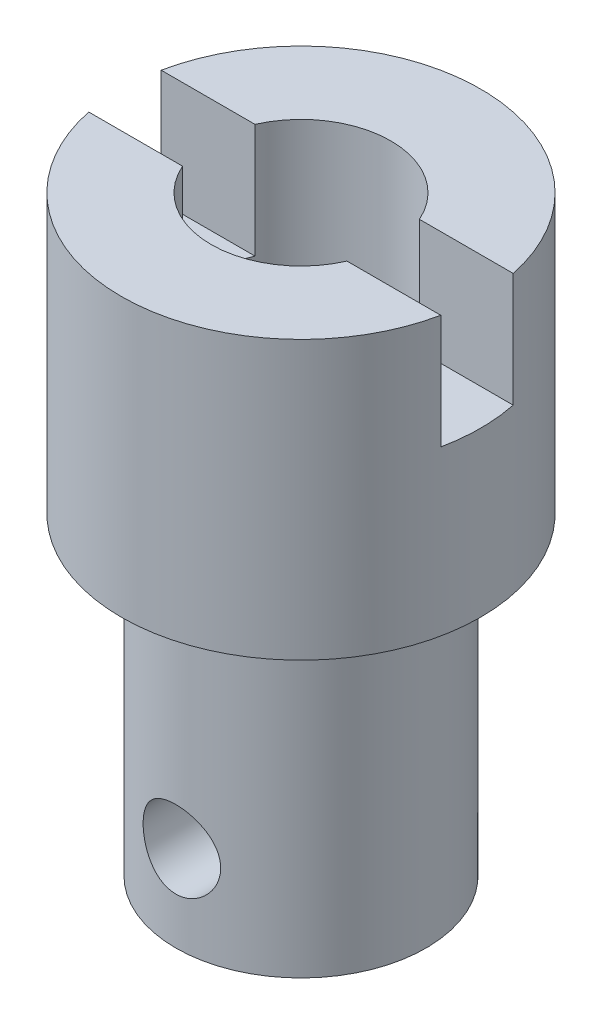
ISO-10303-21;
HEADER;
FILE_DESCRIPTION(('STEP AP214'),'2;1');
FILE_NAME('part.step','',(''),(''),'','','');
FILE_SCHEMA(('AUTOMOTIVE_DESIGN { 1 0 10303 214 1 1 1 1 }'));
ENDSEC;
DATA;
#1=APPLICATION_CONTEXT('core data for automotive mechanical design processes');
#2=APPLICATION_PROTOCOL_DEFINITION('international standard','automotive_design',2000,#1);
#3=PRODUCT_CONTEXT('',#1,'mechanical');
#4=PRODUCT('Part','Part','',(#3));
#5=PRODUCT_RELATED_PRODUCT_CATEGORY('part','',(#4));
#6=PRODUCT_DEFINITION_FORMATION('','',#4);
#7=PRODUCT_DEFINITION_CONTEXT('part definition',#1,'design');
#8=PRODUCT_DEFINITION('design','',#6,#7);
#9=PRODUCT_DEFINITION_SHAPE('','',#8);
#10=(LENGTH_UNIT() NAMED_UNIT(*) SI_UNIT(.MILLI.,.METRE.));
#11=(NAMED_UNIT(*) PLANE_ANGLE_UNIT() SI_UNIT($,.RADIAN.));
#12=(NAMED_UNIT(*) SI_UNIT($,.STERADIAN.) SOLID_ANGLE_UNIT());
#13=UNCERTAINTY_MEASURE_WITH_UNIT(LENGTH_MEASURE(1.E-05),#10,'distance_accuracy_value','');
#14=(GEOMETRIC_REPRESENTATION_CONTEXT(3) GLOBAL_UNCERTAINTY_ASSIGNED_CONTEXT((#13)) GLOBAL_UNIT_ASSIGNED_CONTEXT((#10,
#11,#12)) REPRESENTATION_CONTEXT('',''));
#15=CARTESIAN_POINT('',(0.,0.,0.));
#16=DIRECTION('',(0.,0.,1.));
#17=DIRECTION('',(1.,0.,0.));
#18=AXIS2_PLACEMENT_3D('',#15,#16,#17);
#19=CARTESIAN_POINT('',(2.00025,0.,0.));
#20=DIRECTION('',(0.,-1.,0.));
#21=DIRECTION('',(0.,0.,-1.));
#22=AXIS2_PLACEMENT_3D('',#19,#20,#21);
#23=PLANE('',#22);
#24=CARTESIAN_POINT('',(0.,0.,0.));
#25=DIRECTION('',(0.,1.,0.));
#26=DIRECTION('',(0.,0.,1.));
#27=AXIS2_PLACEMENT_3D('',#24,#25,#26);
#28=CIRCLE('',#27,8.001);
#29=CARTESIAN_POINT('',(7.83674387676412,0.,-1.6129));
#30=VERTEX_POINT('',#29);
#31=CARTESIAN_POINT('',(-7.83674387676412,0.,-1.6129));
#32=VERTEX_POINT('',#31);
#33=EDGE_CURVE('E121',#30,#32,#28,.T.);
#34=ORIENTED_EDGE('',*,*,#33,.T.);
#35=DIRECTION('',(-1.,0.,0.));
#36=VECTOR('',#35,1.);
#37=CARTESIAN_POINT('',(-8.001,0.,-1.6129));
#38=LINE('',#37,#36);
#39=CARTESIAN_POINT('',(-3.66094985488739,0.,-1.6129));
#40=VERTEX_POINT('',#39);
#41=EDGE_CURVE('E114',#40,#32,#38,.T.);
#42=ORIENTED_EDGE('',*,*,#41,.F.);
#43=CARTESIAN_POINT('',(0.,0.,0.));
#44=DIRECTION('',(0.,1.,0.));
#45=DIRECTION('',(0.,0.,1.));
#46=AXIS2_PLACEMENT_3D('',#43,#44,#45);
#47=CIRCLE('',#46,4.0005);
#48=CARTESIAN_POINT('',(3.66094985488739,0.,-1.6129));
#49=VERTEX_POINT('',#48);
#50=EDGE_CURVE('E167',#49,#40,#47,.T.);
#51=ORIENTED_EDGE('',*,*,#50,.F.);
#52=EDGE_CURVE('E180',#30,#49,#38,.T.);
#53=ORIENTED_EDGE('',*,*,#52,.F.);
#54=EDGE_LOOP('',(#34,#42,#51,#53));
#55=FACE_BOUND('',#54,.T.);
#56=ADVANCED_FACE('F31',(#55),#23,.F.);
#57=CARTESIAN_POINT('',(0.,0.,0.));
#58=DIRECTION('',(0.,1.,0.));
#59=DIRECTION('',(0.,0.,1.));
#60=AXIS2_PLACEMENT_3D('',#57,#58,#59);
#61=CYLINDRICAL_SURFACE('',#60,2.00025);
#62=CARTESIAN_POINT('',(0.,-24.257,2.00025));
#63=CARTESIAN_POINT('',(0.0811521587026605,-24.2569960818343,2.00024615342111));
#64=CARTESIAN_POINT('',(0.16233395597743,-24.2512379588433,1.99526809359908));
#65=CARTESIAN_POINT('',(0.321975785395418,-24.2286432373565,1.97580787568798));
#66=CARTESIAN_POINT('',(0.400433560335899,-24.2117976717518,1.96131802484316));
#67=CARTESIAN_POINT('',(0.551939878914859,-24.1683240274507,1.92416588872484));
#68=CARTESIAN_POINT('',(0.625018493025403,-24.1417562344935,1.90155398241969));
#69=CARTESIAN_POINT('',(0.76497501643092,-24.0802475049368,1.84970158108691));
#70=CARTESIAN_POINT('',(0.831850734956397,-24.0453036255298,1.8204587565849));
#71=CARTESIAN_POINT('',(0.983051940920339,-23.9536523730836,1.74477036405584));
#72=CARTESIAN_POINT('',(1.0642771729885,-23.8937315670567,1.69602169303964));
#73=CARTESIAN_POINT('',(1.21337343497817,-23.7630182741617,1.59279392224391));
#74=CARTESIAN_POINT('',(1.28120768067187,-23.6921967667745,1.53829965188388));
#75=CARTESIAN_POINT('',(1.40485807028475,-23.5394840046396,1.42633390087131));
#76=CARTESIAN_POINT('',(1.46039337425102,-23.4573923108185,1.36882399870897));
#77=CARTESIAN_POINT('',(1.53310400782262,-23.3268427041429,1.28528850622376));
#78=CARTESIAN_POINT('',(1.55556503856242,-23.2821203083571,1.25791407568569));
#79=CARTESIAN_POINT('',(1.59685224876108,-23.1899755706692,1.20506491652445));
#80=CARTESIAN_POINT('',(1.61568133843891,-23.1425554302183,1.1795886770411));
#81=CARTESIAN_POINT('',(1.6502489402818,-23.0424710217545,1.13075792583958));
#82=CARTESIAN_POINT('',(1.66580264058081,-22.9896653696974,1.10755751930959));
#83=CARTESIAN_POINT('',(1.69209281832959,-22.8807474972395,1.0669627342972));
#84=CARTESIAN_POINT('',(1.70283990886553,-22.8246428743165,1.0495555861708));
#85=CARTESIAN_POINT('',(1.71764456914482,-22.7179029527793,1.02512253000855));
#86=CARTESIAN_POINT('',(1.72244162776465,-22.6676406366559,1.01696409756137));
#87=CARTESIAN_POINT('',(1.72755867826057,-22.5662501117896,1.00825147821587));
#88=CARTESIAN_POINT('',(1.72788370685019,-22.5151229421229,1.00768873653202));
#89=CARTESIAN_POINT('',(1.72403803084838,-22.4136501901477,1.01425008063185));
#90=CARTESIAN_POINT('',(1.71987464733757,-22.3633034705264,1.02136164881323));
#91=CARTESIAN_POINT('',(1.70742710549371,-22.2644608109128,1.04203432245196));
#92=CARTESIAN_POINT('',(1.69913532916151,-22.2159684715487,1.05560734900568));
#93=CARTESIAN_POINT('',(1.67223932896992,-22.0901445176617,1.0979880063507));
#94=CARTESIAN_POINT('',(1.65044121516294,-22.014925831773,1.13093626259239));
#95=CARTESIAN_POINT('',(1.5983743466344,-21.8707589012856,1.20341542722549));
#96=CARTESIAN_POINT('',(1.56807058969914,-21.8018381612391,1.24297325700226));
#97=CARTESIAN_POINT('',(1.50821353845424,-21.6862303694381,1.31449570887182));
#98=CARTESIAN_POINT('',(1.4803653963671,-21.638291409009,1.3458872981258));
#99=CARTESIAN_POINT('',(1.42034905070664,-21.5454794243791,1.40908202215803));
#100=CARTESIAN_POINT('',(1.38817878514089,-21.5006078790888,1.44088534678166));
#101=CARTESIAN_POINT('',(1.28527582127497,-21.3707143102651,1.53548354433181));
#102=CARTESIAN_POINT('',(1.20802177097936,-21.2901643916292,1.5976303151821));
#103=CARTESIAN_POINT('',(1.05706701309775,-21.1611762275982,1.69994347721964));
#104=CARTESIAN_POINT('',(0.987076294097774,-21.1096936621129,1.74177856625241));
#105=CARTESIAN_POINT('',(0.837364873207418,-21.0165986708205,1.81847631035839));
#106=CARTESIAN_POINT('',(0.757659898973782,-20.9749706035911,1.8533500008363));
#107=CARTESIAN_POINT('',(0.604257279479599,-20.9099935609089,1.90822158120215));
#108=CARTESIAN_POINT('',(0.531926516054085,-20.8847245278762,1.92975189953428));
#109=CARTESIAN_POINT('',(0.38272117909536,-20.8437647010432,1.9647852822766));
#110=CARTESIAN_POINT('',(0.305849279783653,-20.8280683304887,1.97829302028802));
#111=CARTESIAN_POINT('',(0.149265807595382,-20.8072434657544,1.9962346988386));
#112=CARTESIAN_POINT('',(0.06954316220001,-20.8021621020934,2.0006281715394));
#113=CARTESIAN_POINT('',(-0.0897872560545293,-20.8030972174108,1.99982060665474));
#114=CARTESIAN_POINT('',(-0.169395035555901,-20.8091130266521,1.9946201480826));
#115=CARTESIAN_POINT('',(-0.320249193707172,-20.8309609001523,1.97580541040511));
#116=CARTESIAN_POINT('',(-0.391685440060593,-20.8460568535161,1.96282230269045));
#117=CARTESIAN_POINT('',(-0.530583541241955,-20.8845343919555,1.92991711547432));
#118=CARTESIAN_POINT('',(-0.598044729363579,-20.9079173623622,1.90999387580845));
#119=CARTESIAN_POINT('',(-0.73328848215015,-20.9641340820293,1.86248343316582));
#120=CARTESIAN_POINT('',(-0.800633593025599,-20.9975908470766,1.83439761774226));
#121=CARTESIAN_POINT('',(-0.928683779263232,-21.0716344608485,1.77301997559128));
#122=CARTESIAN_POINT('',(-0.989383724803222,-21.112226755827,1.73972417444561));
#123=CARTESIAN_POINT('',(-1.13316926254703,-21.2217524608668,1.65143241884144));
#124=CARTESIAN_POINT('',(-1.21183994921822,-21.2945673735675,1.59404314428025));
#125=CARTESIAN_POINT('',(-1.35358888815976,-21.4517115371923,1.47557818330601));
#126=CARTESIAN_POINT('',(-1.41663072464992,-21.5360669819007,1.41449429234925));
#127=CARTESIAN_POINT('',(-1.51436009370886,-21.6952116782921,1.30830566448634));
#128=CARTESIAN_POINT('',(-1.55223469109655,-21.7677627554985,1.26274712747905));
#129=CARTESIAN_POINT('',(-1.61815323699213,-21.9201522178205,1.17705631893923));
#130=CARTESIAN_POINT('',(-1.64622688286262,-21.9999676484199,1.13690788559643));
#131=CARTESIAN_POINT('',(-1.68210717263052,-22.1342714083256,1.08264900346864));
#132=CARTESIAN_POINT('',(-1.69352999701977,-22.1861406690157,1.06454387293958));
#133=CARTESIAN_POINT('',(-1.71167063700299,-22.2925221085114,1.03512488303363));
#134=CARTESIAN_POINT('',(-1.7184006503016,-22.347027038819,1.02379342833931));
#135=CARTESIAN_POINT('',(-1.72662134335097,-22.4582053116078,1.00987910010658));
#136=CARTESIAN_POINT('',(-1.72805536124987,-22.5148955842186,1.00739085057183));
#137=CARTESIAN_POINT('',(-1.72534601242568,-22.6277605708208,1.01201975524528));
#138=CARTESIAN_POINT('',(-1.72119795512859,-22.6839348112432,1.01914498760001));
#139=CARTESIAN_POINT('',(-1.70658176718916,-22.8038100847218,1.04345737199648));
#140=CARTESIAN_POINT('',(-1.69511225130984,-22.8670507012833,1.06222196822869));
#141=CARTESIAN_POINT('',(-1.66611200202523,-22.9894502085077,1.10714930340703));
#142=CARTESIAN_POINT('',(-1.64855916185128,-23.0485932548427,1.13333896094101));
#143=CARTESIAN_POINT('',(-1.61118323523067,-23.1542662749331,1.18573525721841));
#144=CARTESIAN_POINT('',(-1.59209225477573,-23.2013597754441,1.21135360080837));
#145=CARTESIAN_POINT('',(-1.55031043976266,-23.2928776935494,1.26438983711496));
#146=CARTESIAN_POINT('',(-1.52761720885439,-23.3373003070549,1.29180892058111));
#147=CARTESIAN_POINT('',(-1.45427375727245,-23.4669190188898,1.37533865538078));
#148=CARTESIAN_POINT('',(-1.39837932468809,-23.5484120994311,1.4326924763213));
#149=CARTESIAN_POINT('',(-1.26932558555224,-23.7057855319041,1.54847799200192));
#150=CARTESIAN_POINT('',(-1.19538488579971,-23.7811094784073,1.60679504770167));
#151=CARTESIAN_POINT('',(-1.03195954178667,-23.9189102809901,1.71629648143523));
#152=CARTESIAN_POINT('',(-0.94251803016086,-23.9814217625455,1.76749995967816));
#153=CARTESIAN_POINT('',(-0.778104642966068,-24.073751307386,1.84421524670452));
#154=CARTESIAN_POINT('',(-0.706914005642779,-24.1077422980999,1.87281681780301));
#155=CARTESIAN_POINT('',(-0.558246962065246,-24.166239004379,1.92236012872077));
#156=CARTESIAN_POINT('',(-0.480779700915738,-24.1907582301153,1.94331277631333));
#157=CARTESIAN_POINT('',(-0.336272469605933,-24.2252592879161,1.9728914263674));
#158=CARTESIAN_POINT('',(-0.269997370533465,-24.2371038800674,1.98309122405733));
#159=CARTESIAN_POINT('',(-0.135821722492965,-24.2529757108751,1.9967719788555));
#160=CARTESIAN_POINT('',(-0.0679212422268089,-24.2570032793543,2.0002532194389));
#161=CARTESIAN_POINT('',(0.,-24.257,2.00025));
#162=B_SPLINE_CURVE_WITH_KNOTS('',3,(#62,#63,#64,#65,#66,#67,#68,#69,#70,#71,#72,#73,#74,#75,
#76,#77,#78,#79,#80,#81,#82,#83,#84,#85,#86,#87,#88,#89,#90,#91,#92,#93,#94,#95,#96,#97,#98,#99,
#100,#101,#102,#103,#104,#105,#106,#107,#108,#109,#110,#111,#112,#113,#114,#115,#116,#117,#118,
#119,#120,#121,#122,#123,#124,#125,#126,#127,#128,#129,#130,#131,#132,#133,#134,#135,#136,#137,
#138,#139,#140,#141,#142,#143,#144,#145,#146,#147,#148,#149,#150,#151,#152,#153,#154,#155,#156,
#157,#158,#159,#160,#161),.UNSPECIFIED.,.T.,.F.,(4,2,2,2,2,2,2,2,2,2,2,2,2,2,2,2,2,2,2,2,2,2,2,
2,2,2,2,2,2,2,2,2,2,2,2,2,2,2,2,2,2,2,2,2,2,2,2,2,2,4),(0.,0.243167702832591,0.486532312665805,
0.728412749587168,0.970378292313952,1.30482711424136,1.64018223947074,1.98254698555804,
2.15352126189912,2.32435796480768,2.50315221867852,2.68154971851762,2.83430511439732,
2.98688845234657,3.13922328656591,3.29184026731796,3.5452867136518,3.79979182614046,
3.9906921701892,4.18168391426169,4.56270420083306,4.85100577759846,5.1388466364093,
5.37661631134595,5.61424733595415,5.85293121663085,6.09160069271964,6.3131272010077,
6.53469075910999,6.77463162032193,7.0147564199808,7.37760885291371,7.7412989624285,
8.02163965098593,8.30112336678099,8.46896291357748,8.63636456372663,8.8055521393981,
8.97488197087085,9.17462696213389,9.37510557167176,9.54560212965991,9.71621258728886,
10.0576245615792,10.4178420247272,10.7770727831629,11.0278735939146,11.2783153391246,
11.481845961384,11.685367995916),.UNSPECIFIED.);
#163=CARTESIAN_POINT('',(0.,-24.257,2.00025));
#164=VERTEX_POINT('',#163);
#165=EDGE_CURVE('E198',#164,#164,#162,.T.);
#166=ORIENTED_EDGE('',*,*,#165,.T.);
#167=EDGE_LOOP('',(#166));
#168=FACE_BOUND('',#167,.T.);
#169=CARTESIAN_POINT('',(0.,-26.3398,0.));
#170=DIRECTION('',(0.,1.,0.));
#171=DIRECTION('',(0.,0.,1.));
#172=AXIS2_PLACEMENT_3D('',#169,#170,#171);
#173=CIRCLE('',#172,2.00025);
#174=CARTESIAN_POINT('',(0.,-26.3398,2.00025));
#175=VERTEX_POINT('',#174);
#176=EDGE_CURVE('E125',#175,#175,#173,.T.);
#177=ORIENTED_EDGE('',*,*,#176,.F.);
#178=EDGE_LOOP('',(#177));
#179=FACE_BOUND('',#178,.T.);
#180=CARTESIAN_POINT('',(0.,-8.0518,0.));
#181=DIRECTION('',(0.,1.,0.));
#182=DIRECTION('',(0.,0.,1.));
#183=AXIS2_PLACEMENT_3D('',#180,#181,#182);
#184=CIRCLE('',#183,2.00025);
#185=CARTESIAN_POINT('',(0.,-8.0518,2.00025));
#186=VERTEX_POINT('',#185);
#187=EDGE_CURVE('E122',#186,#186,#184,.F.);
#188=ORIENTED_EDGE('',*,*,#187,.F.);
#189=EDGE_LOOP('',(#188));
#190=FACE_BOUND('',#189,.T.);
#191=ADVANCED_FACE('F239',(#168,#179,#190),#61,.F.);
#192=CARTESIAN_POINT('',(0.,0.,0.));
#193=DIRECTION('',(0.,1.,0.));
#194=DIRECTION('',(0.,0.,1.));
#195=AXIS2_PLACEMENT_3D('',#192,#193,#194);
#196=CYLINDRICAL_SURFACE('',#195,8.001);
#197=ORIENTED_EDGE('',*,*,#33,.F.);
#198=DIRECTION('',(0.,1.,0.));
#199=VECTOR('',#198,1.);
#200=CARTESIAN_POINT('',(7.83674387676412,0.,-1.6129));
#201=LINE('',#200,#199);
#202=CARTESIAN_POINT('',(7.83674387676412,-5.08,-1.6129));
#203=VERTEX_POINT('',#202);
#204=EDGE_CURVE('E172',#30,#203,#201,.F.);
#205=ORIENTED_EDGE('',*,*,#204,.T.);
#206=CARTESIAN_POINT('',(0.,-5.08,0.));
#207=DIRECTION('',(0.,1.,0.));
#208=DIRECTION('',(0.,0.,1.));
#209=AXIS2_PLACEMENT_3D('',#206,#207,#208);
#210=CIRCLE('',#209,8.001);
#211=CARTESIAN_POINT('',(7.83674387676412,-5.08,1.6129));
#212=VERTEX_POINT('',#211);
#213=EDGE_CURVE('E104',#212,#203,#210,.T.);
#214=ORIENTED_EDGE('',*,*,#213,.F.);
#215=DIRECTION('',(0.,1.,0.));
#216=VECTOR('',#215,1.);
#217=CARTESIAN_POINT('',(7.83674387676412,0.,1.6129));
#218=LINE('',#217,#216);
#219=CARTESIAN_POINT('',(7.83674387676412,0.,1.6129));
#220=VERTEX_POINT('',#219);
#221=EDGE_CURVE('E103',#212,#220,#218,.T.);
#222=ORIENTED_EDGE('',*,*,#221,.T.);
#223=CARTESIAN_POINT('',(-7.83674387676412,0.,1.6129));
#224=VERTEX_POINT('',#223);
#225=EDGE_CURVE('E111',#224,#220,#28,.T.);
#226=ORIENTED_EDGE('',*,*,#225,.F.);
#227=DIRECTION('',(0.,1.,0.));
#228=VECTOR('',#227,1.);
#229=CARTESIAN_POINT('',(-7.83674387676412,0.,1.6129));
#230=LINE('',#229,#228);
#231=CARTESIAN_POINT('',(-7.83674387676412,-5.08,1.6129));
#232=VERTEX_POINT('',#231);
#233=EDGE_CURVE('E95',#224,#232,#230,.F.);
#234=ORIENTED_EDGE('',*,*,#233,.T.);
#235=CARTESIAN_POINT('',(-7.83674387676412,-5.08,-1.6129));
#236=VERTEX_POINT('',#235);
#237=EDGE_CURVE('E179',#236,#232,#210,.T.);
#238=ORIENTED_EDGE('',*,*,#237,.F.);
#239=DIRECTION('',(0.,1.,0.));
#240=VECTOR('',#239,1.);
#241=CARTESIAN_POINT('',(-7.83674387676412,0.,-1.6129));
#242=LINE('',#241,#240);
#243=EDGE_CURVE('E161',#236,#32,#242,.T.);
#244=ORIENTED_EDGE('',*,*,#243,.T.);
#245=EDGE_LOOP('',(#197,#205,#214,#222,#226,#234,#238,#244));
#246=FACE_BOUND('',#245,.T.);
#247=CARTESIAN_POINT('',(0.,-12.3698,0.));
#248=DIRECTION('',(0.,1.,0.));
#249=DIRECTION('',(0.,0.,1.));
#250=AXIS2_PLACEMENT_3D('',#247,#248,#249);
#251=CIRCLE('',#250,8.001);
#252=CARTESIAN_POINT('',(0.,-12.3698,8.001));
#253=VERTEX_POINT('',#252);
#254=EDGE_CURVE('E140',#253,#253,#251,.T.);
#255=ORIENTED_EDGE('',*,*,#254,.T.);
#256=EDGE_LOOP('',(#255));
#257=FACE_BOUND('',#256,.T.);
#258=ADVANCED_FACE('F33',(#246,#257),#196,.T.);
#259=CARTESIAN_POINT('',(8.001,-12.3698,0.));
#260=DIRECTION('',(0.,1.,0.));
#261=DIRECTION('',(0.,0.,1.));
#262=AXIS2_PLACEMENT_3D('',#259,#260,#261);
#263=PLANE('',#262);
#264=CARTESIAN_POINT('',(0.,-12.3698,6.858));
#265=DIRECTION('',(0.,-1.,0.));
#266=DIRECTION('',(0.,0.,-1.));
#267=AXIS2_PLACEMENT_3D('',#264,#265,#266);
#268=CIRCLE('',#267,0.79375);
#269=CARTESIAN_POINT('',(0.,-12.3698,6.06425));
#270=VERTEX_POINT('',#269);
#271=EDGE_CURVE('E186',#270,#270,#268,.T.);
#272=ORIENTED_EDGE('',*,*,#271,.F.);
#273=EDGE_LOOP('',(#272));
#274=FACE_BOUND('',#273,.T.);
#275=ORIENTED_EDGE('',*,*,#254,.F.);
#276=EDGE_LOOP('',(#275));
#277=FACE_BOUND('',#276,.T.);
#278=CARTESIAN_POINT('',(0.,-12.3698,0.));
#279=DIRECTION('',(0.,1.,0.));
#280=DIRECTION('',(0.,0.,1.));
#281=AXIS2_PLACEMENT_3D('',#278,#279,#280);
#282=CIRCLE('',#281,5.5753);
#283=CARTESIAN_POINT('',(0.,-12.3698,5.5753));
#284=VERTEX_POINT('',#283);
#285=EDGE_CURVE('E137',#284,#284,#282,.T.);
#286=ORIENTED_EDGE('',*,*,#285,.T.);
#287=EDGE_LOOP('',(#286));
#288=FACE_BOUND('',#287,.T.);
#289=ADVANCED_FACE('F247',(#274,#277,#288),#263,.F.);
#290=CARTESIAN_POINT('',(0.,0.,0.));
#291=DIRECTION('',(0.,1.,0.));
#292=DIRECTION('',(0.,0.,1.));
#293=AXIS2_PLACEMENT_3D('',#290,#291,#292);
#294=CYLINDRICAL_SURFACE('',#293,5.5753);
#295=CARTESIAN_POINT('',(0.,-24.257,5.5753));
#296=CARTESIAN_POINT('',(-0.094607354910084,-24.2569992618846,5.57529944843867));
#297=CARTESIAN_POINT('',(-0.189222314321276,-24.2492011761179,5.57286911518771));
#298=CARTESIAN_POINT('',(-0.375687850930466,-24.2182949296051,5.56341199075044));
#299=CARTESIAN_POINT('',(-0.467537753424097,-24.1951830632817,5.55638408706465));
#300=CARTESIAN_POINT('',(-0.645757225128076,-24.1345015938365,5.53850007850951));
#301=CARTESIAN_POINT('',(-0.732134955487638,-24.0969541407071,5.52764984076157));
#302=CARTESIAN_POINT('',(-0.897368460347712,-24.0085608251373,5.50324309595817));
#303=CARTESIAN_POINT('',(-0.97622308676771,-23.9577129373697,5.48968617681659));
#304=CARTESIAN_POINT('',(-1.12657022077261,-23.8425341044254,5.46084555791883));
#305=CARTESIAN_POINT('',(-1.19780180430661,-23.7778718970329,5.44552472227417));
#306=CARTESIAN_POINT('',(-1.32860303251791,-23.6376054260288,5.41509952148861));
#307=CARTESIAN_POINT('',(-1.38817055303,-23.5619991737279,5.39999519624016));
#308=CARTESIAN_POINT('',(-1.49535837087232,-23.3997431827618,5.37131593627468));
#309=CARTESIAN_POINT('',(-1.54265435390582,-23.312870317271,5.35778690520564));
#310=CARTESIAN_POINT('',(-1.62185754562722,-23.1319169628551,5.33434781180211));
#311=CARTESIAN_POINT('',(-1.65376872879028,-23.0378383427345,5.32443681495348));
#312=CARTESIAN_POINT('',(-1.70034476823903,-22.8480852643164,5.30974407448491));
#313=CARTESIAN_POINT('',(-1.71549299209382,-22.7525408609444,5.30481894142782));
#314=CARTESIAN_POINT('',(-1.72962306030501,-22.5601495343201,5.30022965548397));
#315=CARTESIAN_POINT('',(-1.72860911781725,-22.4633029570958,5.30056413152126));
#316=CARTESIAN_POINT('',(-1.71082204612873,-22.2750398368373,5.3063295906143));
#317=CARTESIAN_POINT('',(-1.6946614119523,-22.1835583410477,5.31156248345));
#318=CARTESIAN_POINT('',(-1.64803200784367,-22.0046748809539,5.32621365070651));
#319=CARTESIAN_POINT('',(-1.61756174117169,-21.9172733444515,5.33563236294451));
#320=CARTESIAN_POINT('',(-1.54274140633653,-21.7475631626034,5.35774710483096));
#321=CARTESIAN_POINT('',(-1.49819763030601,-21.665346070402,5.37048841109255));
#322=CARTESIAN_POINT('',(-1.39662926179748,-21.5093516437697,5.39779174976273));
#323=CARTESIAN_POINT('',(-1.3396014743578,-21.4355764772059,5.41235424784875));
#324=CARTESIAN_POINT('',(-1.21167036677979,-21.2950949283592,5.44245573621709));
#325=CARTESIAN_POINT('',(-1.14026082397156,-21.2288518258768,5.4580092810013));
#326=CARTESIAN_POINT('',(-0.987152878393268,-21.1091695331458,5.48776576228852));
#327=CARTESIAN_POINT('',(-0.905453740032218,-21.0557312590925,5.50196860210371));
#328=CARTESIAN_POINT('',(-0.73320409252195,-20.9628688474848,5.52756815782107));
#329=CARTESIAN_POINT('',(-0.642591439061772,-20.9235535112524,5.53894288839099));
#330=CARTESIAN_POINT('',(-0.45560470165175,-20.8608602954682,5.55744596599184));
#331=CARTESIAN_POINT('',(-0.359232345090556,-20.8374776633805,5.56457557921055));
#332=CARTESIAN_POINT('',(-0.167395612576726,-20.8080988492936,5.57358212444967));
#333=CARTESIAN_POINT('',(-0.0720360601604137,-20.8014753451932,5.5756484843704));
#334=CARTESIAN_POINT('',(0.118441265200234,-20.8040363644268,5.57485495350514));
#335=CARTESIAN_POINT('',(0.213559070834,-20.8132186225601,5.5719957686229));
#336=CARTESIAN_POINT('',(0.398444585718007,-20.8466260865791,5.5617967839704));
#337=CARTESIAN_POINT('',(0.488286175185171,-20.8704794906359,5.55456780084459));
#338=CARTESIAN_POINT('',(0.662668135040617,-20.9320998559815,5.5364729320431));
#339=CARTESIAN_POINT('',(0.747207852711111,-20.9698685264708,5.52560659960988));
#340=CARTESIAN_POINT('',(0.910853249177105,-21.0592665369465,5.50103014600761));
#341=CARTESIAN_POINT('',(0.989778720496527,-21.1112081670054,5.48725776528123));
#342=CARTESIAN_POINT('',(1.13800433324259,-21.227101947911,5.45844548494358));
#343=CARTESIAN_POINT('',(1.20730189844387,-21.2910573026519,5.44340524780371));
#344=CARTESIAN_POINT('',(1.33710160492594,-21.4321130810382,5.41301672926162));
#345=CARTESIAN_POINT('',(1.39715678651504,-21.5096280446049,5.39767922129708));
#346=CARTESIAN_POINT('',(1.50344520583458,-21.673968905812,5.3690467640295));
#347=CARTESIAN_POINT('',(1.54967869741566,-21.7607946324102,5.35575177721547));
#348=CARTESIAN_POINT('',(1.62671688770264,-21.9410901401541,5.33285858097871));
#349=CARTESIAN_POINT('',(1.65758424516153,-22.0345311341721,5.32324539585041));
#350=CARTESIAN_POINT('',(1.70304014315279,-22.2256421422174,5.30887970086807));
#351=CARTESIAN_POINT('',(1.71763474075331,-22.3233105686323,5.30412538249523));
#352=CARTESIAN_POINT('',(1.72970087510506,-22.5154380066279,5.30020193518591));
#353=CARTESIAN_POINT('',(1.72790461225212,-22.6098467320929,5.30079396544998));
#354=CARTESIAN_POINT('',(1.70900322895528,-22.7969475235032,5.30691760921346));
#355=CARTESIAN_POINT('',(1.69189879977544,-22.8896396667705,5.31244899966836));
#356=CARTESIAN_POINT('',(1.64335299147,-23.0693915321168,5.32766266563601));
#357=CARTESIAN_POINT('',(1.61211769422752,-23.1565123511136,5.33728515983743));
#358=CARTESIAN_POINT('',(1.536358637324,-23.3243462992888,5.35958247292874));
#359=CARTESIAN_POINT('',(1.49183220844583,-23.4050581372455,5.37225790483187));
#360=CARTESIAN_POINT('',(1.38874744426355,-23.5611495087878,5.39984238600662));
#361=CARTESIAN_POINT('',(1.32971448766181,-23.6362036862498,5.41481868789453));
#362=CARTESIAN_POINT('',(1.20013174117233,-23.7755777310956,5.44500444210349));
#363=CARTESIAN_POINT('',(1.12957889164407,-23.8398947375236,5.46021395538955));
#364=CARTESIAN_POINT('',(0.976251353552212,-23.9580199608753,5.48973420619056));
#365=CARTESIAN_POINT('',(0.893158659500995,-24.0114276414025,5.50400081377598));
#366=CARTESIAN_POINT('',(0.71873226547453,-24.1034443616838,5.52947950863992));
#367=CARTESIAN_POINT('',(0.627401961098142,-24.1420594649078,5.54069284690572));
#368=CARTESIAN_POINT('',(0.447537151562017,-24.2004452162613,5.55797630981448));
#369=CARTESIAN_POINT('',(0.359483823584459,-24.2215929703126,5.56441688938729));
#370=CARTESIAN_POINT('',(0.180955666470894,-24.249869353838,5.57307858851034));
#371=CARTESIAN_POINT('',(0.0904813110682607,-24.2570007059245,5.57530052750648));
#372=CARTESIAN_POINT('',(0.,-24.257,5.5753));
#373=B_SPLINE_CURVE_WITH_KNOTS('',3,(#295,#296,#297,#298,#299,#300,#301,#302,#303,#304,#305,
#306,#307,#308,#309,#310,#311,#312,#313,#314,#315,#316,#317,#318,#319,#320,#321,#322,#323,#324,
#325,#326,#327,#328,#329,#330,#331,#332,#333,#334,#335,#336,#337,#338,#339,#340,#341,#342,#343,
#344,#345,#346,#347,#348,#349,#350,#351,#352,#353,#354,#355,#356,#357,#358,#359,#360,#361,#362,
#363,#364,#365,#366,#367,#368,#369,#370,#371,#372),.UNSPECIFIED.,.T.,.F.,(4,2,2,2,2,2,2,2,2,2,2,
2,2,2,2,2,2,2,2,2,2,2,2,2,2,2,2,2,2,2,2,2,2,2,2,2,2,2,4),(0.,0.283489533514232,
0.567047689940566,0.850172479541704,1.13334040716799,1.42426716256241,1.71524685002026,
2.0132742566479,2.31122463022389,2.60033945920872,2.88937892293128,3.16721255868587,
3.44507526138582,3.72694254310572,4.00888204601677,4.30342209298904,4.59798320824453,
4.89476723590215,5.19146269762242,5.47687609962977,5.7622486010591,6.04067114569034,
6.31912790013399,6.60429972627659,6.88954771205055,7.1858909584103,7.4822287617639,
7.77734807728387,8.07235750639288,8.35425532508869,8.63614041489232,8.91404083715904,
9.19199710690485,9.48066497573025,9.76940963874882,10.0673624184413,10.3651929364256,
10.6363715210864,10.9074974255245),.UNSPECIFIED.);
#374=CARTESIAN_POINT('',(0.,-24.257,5.5753));
#375=VERTEX_POINT('',#374);
#376=EDGE_CURVE('E189',#375,#375,#373,.T.);
#377=ORIENTED_EDGE('',*,*,#376,.T.);
#378=EDGE_LOOP('',(#377));
#379=FACE_BOUND('',#378,.T.);
#380=ORIENTED_EDGE('',*,*,#285,.F.);
#381=EDGE_LOOP('',(#380));
#382=FACE_BOUND('',#381,.T.);
#383=CARTESIAN_POINT('',(0.,-26.3398,0.));
#384=DIRECTION('',(0.,1.,0.));
#385=DIRECTION('',(0.,0.,1.));
#386=AXIS2_PLACEMENT_3D('',#383,#384,#385);
#387=CIRCLE('',#386,5.5753);
#388=CARTESIAN_POINT('',(0.,-26.3398,5.5753));
#389=VERTEX_POINT('',#388);
#390=EDGE_CURVE('E134',#389,#389,#387,.T.);
#391=ORIENTED_EDGE('',*,*,#390,.T.);
#392=EDGE_LOOP('',(#391));
#393=FACE_BOUND('',#392,.T.);
#394=ADVANCED_FACE('F202',(#379,#382,#393),#294,.T.);
#395=CARTESIAN_POINT('',(5.5753,-26.3398,0.));
#396=DIRECTION('',(0.,1.,0.));
#397=DIRECTION('',(0.,0.,1.));
#398=AXIS2_PLACEMENT_3D('',#395,#396,#397);
#399=PLANE('',#398);
#400=ORIENTED_EDGE('',*,*,#390,.F.);
#401=EDGE_LOOP('',(#400));
#402=FACE_BOUND('',#401,.T.);
#403=ORIENTED_EDGE('',*,*,#176,.T.);
#404=EDGE_LOOP('',(#403));
#405=FACE_BOUND('',#404,.T.);
#406=ADVANCED_FACE('F238',(#402,#405),#399,.F.);
#407=ORIENTED_EDGE('',*,*,#225,.T.);
#408=DIRECTION('',(1.,0.,0.));
#409=VECTOR('',#408,1.);
#410=CARTESIAN_POINT('',(-8.001,0.,1.6129));
#411=LINE('',#410,#409);
#412=CARTESIAN_POINT('',(3.66094985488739,0.,1.6129));
#413=VERTEX_POINT('',#412);
#414=EDGE_CURVE('E115',#413,#220,#411,.T.);
#415=ORIENTED_EDGE('',*,*,#414,.F.);
#416=CARTESIAN_POINT('',(-3.66094985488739,0.,1.6129));
#417=VERTEX_POINT('',#416);
#418=EDGE_CURVE('E113',#417,#413,#47,.T.);
#419=ORIENTED_EDGE('',*,*,#418,.F.);
#420=EDGE_CURVE('E98',#224,#417,#411,.T.);
#421=ORIENTED_EDGE('',*,*,#420,.F.);
#422=EDGE_LOOP('',(#407,#415,#419,#421));
#423=FACE_BOUND('',#422,.T.);
#424=ADVANCED_FACE('F109',(#423),#23,.F.);
#425=CARTESIAN_POINT('',(0.,-8.0518,0.));
#426=DIRECTION('',(0.,1.,0.));
#427=DIRECTION('',(0.,0.,1.));
#428=AXIS2_PLACEMENT_3D('',#425,#426,#427);
#429=PLANE('',#428);
#430=CARTESIAN_POINT('',(0.,-8.0518,0.));
#431=DIRECTION('',(0.,1.,0.));
#432=DIRECTION('',(0.,0.,1.));
#433=AXIS2_PLACEMENT_3D('',#430,#431,#432);
#434=CIRCLE('',#433,4.0005);
#435=CARTESIAN_POINT('',(0.,-8.0518,4.0005));
#436=VERTEX_POINT('',#435);
#437=EDGE_CURVE('E127',#436,#436,#434,.T.);
#438=ORIENTED_EDGE('',*,*,#437,.T.);
#439=EDGE_LOOP('',(#438));
#440=FACE_BOUND('',#439,.T.);
#441=ORIENTED_EDGE('',*,*,#187,.T.);
#442=EDGE_LOOP('',(#441));
#443=FACE_BOUND('',#442,.T.);
#444=ADVANCED_FACE('F230',(#440,#443),#429,.T.);
#445=CARTESIAN_POINT('',(0.,-8.0518,0.));
#446=DIRECTION('',(0.,1.,0.));
#447=DIRECTION('',(0.,0.,1.));
#448=AXIS2_PLACEMENT_3D('',#445,#446,#447);
#449=CYLINDRICAL_SURFACE('',#448,4.0005);
#450=ORIENTED_EDGE('',*,*,#50,.T.);
#451=DIRECTION('',(0.,1.,0.));
#452=VECTOR('',#451,1.);
#453=CARTESIAN_POINT('',(-3.66094985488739,-8.0518,-1.6129));
#454=LINE('',#453,#452);
#455=CARTESIAN_POINT('',(-3.66094985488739,-5.08,-1.6129));
#456=VERTEX_POINT('',#455);
#457=EDGE_CURVE('E11',#40,#456,#454,.F.);
#458=ORIENTED_EDGE('',*,*,#457,.T.);
#459=CARTESIAN_POINT('',(0.,-5.08,0.));
#460=DIRECTION('',(0.,1.,0.));
#461=DIRECTION('',(0.,0.,1.));
#462=AXIS2_PLACEMENT_3D('',#459,#460,#461);
#463=CIRCLE('',#462,4.0005);
#464=CARTESIAN_POINT('',(-3.66094985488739,-5.08,1.6129));
#465=VERTEX_POINT('',#464);
#466=EDGE_CURVE('E146',#465,#456,#463,.F.);
#467=ORIENTED_EDGE('',*,*,#466,.F.);
#468=DIRECTION('',(0.,1.,0.));
#469=VECTOR('',#468,1.);
#470=CARTESIAN_POINT('',(-3.66094985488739,-8.0518,1.6129));
#471=LINE('',#470,#469);
#472=EDGE_CURVE('E39',#465,#417,#471,.T.);
#473=ORIENTED_EDGE('',*,*,#472,.T.);
#474=ORIENTED_EDGE('',*,*,#418,.T.);
#475=DIRECTION('',(0.,1.,0.));
#476=VECTOR('',#475,1.);
#477=CARTESIAN_POINT('',(3.66094985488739,-8.0518,1.6129));
#478=LINE('',#477,#476);
#479=CARTESIAN_POINT('',(3.66094985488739,-5.08,1.6129));
#480=VERTEX_POINT('',#479);
#481=EDGE_CURVE('E145',#413,#480,#478,.F.);
#482=ORIENTED_EDGE('',*,*,#481,.T.);
#483=CARTESIAN_POINT('',(3.66094985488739,-5.08,-1.6129));
#484=VERTEX_POINT('',#483);
#485=EDGE_CURVE('E142',#484,#480,#463,.F.);
#486=ORIENTED_EDGE('',*,*,#485,.F.);
#487=DIRECTION('',(0.,1.,0.));
#488=VECTOR('',#487,1.);
#489=CARTESIAN_POINT('',(3.66094985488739,-8.0518,-1.6129));
#490=LINE('',#489,#488);
#491=EDGE_CURVE('E149',#484,#49,#490,.T.);
#492=ORIENTED_EDGE('',*,*,#491,.T.);
#493=EDGE_LOOP('',(#450,#458,#467,#473,#474,#482,#486,#492));
#494=FACE_BOUND('',#493,.T.);
#495=ORIENTED_EDGE('',*,*,#437,.F.);
#496=EDGE_LOOP('',(#495));
#497=FACE_BOUND('',#496,.T.);
#498=ADVANCED_FACE('F164',(#494,#497),#449,.F.);
#499=CARTESIAN_POINT('',(-8.001,-5.08,1.6129));
#500=DIRECTION('',(0.,1.,0.));
#501=DIRECTION('',(0.,0.,1.));
#502=AXIS2_PLACEMENT_3D('',#499,#500,#501);
#503=PLANE('',#502);
#504=ORIENTED_EDGE('',*,*,#213,.T.);
#505=DIRECTION('',(-1.,0.,0.));
#506=VECTOR('',#505,1.);
#507=CARTESIAN_POINT('',(-8.001,-5.08,-1.6129));
#508=LINE('',#507,#506);
#509=EDGE_CURVE('E54',#203,#484,#508,.T.);
#510=ORIENTED_EDGE('',*,*,#509,.T.);
#511=ORIENTED_EDGE('',*,*,#485,.T.);
#512=DIRECTION('',(1.,0.,0.));
#513=VECTOR('',#512,1.);
#514=CARTESIAN_POINT('',(-8.001,-5.08,1.6129));
#515=LINE('',#514,#513);
#516=EDGE_CURVE('E183',#480,#212,#515,.T.);
#517=ORIENTED_EDGE('',*,*,#516,.T.);
#518=EDGE_LOOP('',(#504,#510,#511,#517));
#519=FACE_BOUND('',#518,.T.);
#520=ADVANCED_FACE('F220',(#519),#503,.T.);
#521=CARTESIAN_POINT('',(-8.001,-5.08,1.6129));
#522=DIRECTION('',(0.,0.,1.));
#523=DIRECTION('',(1.,0.,0.));
#524=AXIS2_PLACEMENT_3D('',#521,#522,#523);
#525=PLANE('',#524);
#526=ORIENTED_EDGE('',*,*,#516,.F.);
#527=ORIENTED_EDGE('',*,*,#481,.F.);
#528=ORIENTED_EDGE('',*,*,#414,.T.);
#529=ORIENTED_EDGE('',*,*,#221,.F.);
#530=EDGE_LOOP('',(#526,#527,#528,#529));
#531=FACE_BOUND('',#530,.T.);
#532=ADVANCED_FACE('F223',(#531),#525,.F.);
#533=CARTESIAN_POINT('',(-8.001,-5.08,-1.6129));
#534=DIRECTION('',(0.,0.,-1.));
#535=DIRECTION('',(-1.,0.,0.));
#536=AXIS2_PLACEMENT_3D('',#533,#534,#535);
#537=PLANE('',#536);
#538=ORIENTED_EDGE('',*,*,#52,.T.);
#539=ORIENTED_EDGE('',*,*,#491,.F.);
#540=ORIENTED_EDGE('',*,*,#509,.F.);
#541=ORIENTED_EDGE('',*,*,#204,.F.);
#542=EDGE_LOOP('',(#538,#539,#540,#541));
#543=FACE_BOUND('',#542,.T.);
#544=ADVANCED_FACE('F226',(#543),#537,.F.);
#545=EDGE_CURVE('E156',#456,#236,#508,.T.);
#546=ORIENTED_EDGE('',*,*,#545,.F.);
#547=ORIENTED_EDGE('',*,*,#457,.F.);
#548=ORIENTED_EDGE('',*,*,#41,.T.);
#549=ORIENTED_EDGE('',*,*,#243,.F.);
#550=EDGE_LOOP('',(#546,#547,#548,#549));
#551=FACE_BOUND('',#550,.T.);
#552=ADVANCED_FACE('F158',(#551),#537,.F.);
#553=ORIENTED_EDGE('',*,*,#420,.T.);
#554=ORIENTED_EDGE('',*,*,#472,.F.);
#555=EDGE_CURVE('E46',#232,#465,#515,.T.);
#556=ORIENTED_EDGE('',*,*,#555,.F.);
#557=ORIENTED_EDGE('',*,*,#233,.F.);
#558=EDGE_LOOP('',(#553,#554,#556,#557));
#559=FACE_BOUND('',#558,.T.);
#560=ADVANCED_FACE('F97',(#559),#525,.F.);
#561=ORIENTED_EDGE('',*,*,#237,.T.);
#562=ORIENTED_EDGE('',*,*,#555,.T.);
#563=ORIENTED_EDGE('',*,*,#466,.T.);
#564=ORIENTED_EDGE('',*,*,#545,.T.);
#565=EDGE_LOOP('',(#561,#562,#563,#564));
#566=FACE_BOUND('',#565,.T.);
#567=ADVANCED_FACE('F155',(#566),#503,.T.);
#568=CARTESIAN_POINT('',(0.,-6.0198,6.858));
#569=DIRECTION('',(0.,-1.,0.));
#570=DIRECTION('',(0.,0.,-1.));
#571=AXIS2_PLACEMENT_3D('',#568,#569,#570);
#572=CYLINDRICAL_SURFACE('',#571,0.79375);
#573=CARTESIAN_POINT('',(0.,-6.0198,6.858));
#574=DIRECTION('',(0.,-1.,0.));
#575=DIRECTION('',(0.,0.,-1.));
#576=AXIS2_PLACEMENT_3D('',#573,#574,#575);
#577=CIRCLE('',#576,0.79375);
#578=CARTESIAN_POINT('',(0.,-6.0198,6.06425));
#579=VERTEX_POINT('',#578);
#580=EDGE_CURVE('E181',#579,#579,#577,.T.);
#581=ORIENTED_EDGE('',*,*,#580,.F.);
#582=EDGE_LOOP('',(#581));
#583=FACE_BOUND('',#582,.T.);
#584=ORIENTED_EDGE('',*,*,#271,.T.);
#585=EDGE_LOOP('',(#584));
#586=FACE_BOUND('',#585,.T.);
#587=ADVANCED_FACE('F215',(#583,#586),#572,.F.);
#588=CARTESIAN_POINT('',(0.,-6.0198,6.858));
#589=DIRECTION('',(0.,-1.,0.));
#590=DIRECTION('',(0.,0.,-1.));
#591=AXIS2_PLACEMENT_3D('',#588,#589,#590);
#592=PLANE('',#591);
#593=ORIENTED_EDGE('',*,*,#580,.T.);
#594=EDGE_LOOP('',(#593));
#595=FACE_BOUND('',#594,.T.);
#596=ADVANCED_FACE('F208',(#595),#592,.T.);
#597=CARTESIAN_POINT('',(0.,-22.5298,5.5753));
#598=DIRECTION('',(0.,0.,1.));
#599=DIRECTION('',(1.,0.,0.));
#600=AXIS2_PLACEMENT_3D('',#597,#598,#599);
#601=CYLINDRICAL_SURFACE('',#600,1.72719999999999);
#602=ORIENTED_EDGE('',*,*,#165,.F.);
#603=EDGE_LOOP('',(#602));
#604=FACE_BOUND('',#603,.T.);
#605=ORIENTED_EDGE('',*,*,#376,.F.);
#606=EDGE_LOOP('',(#605));
#607=FACE_BOUND('',#606,.T.);
#608=ADVANCED_FACE('F205',(#604,#607),#601,.F.);
#609=CLOSED_SHELL('',(#56,#191,#258,#289,#394,#406,#424,#444,#498,#520,#532,#544,#552,#560,#567,
#587,#596,#608));
#610=MANIFOLD_SOLID_BREP('B2',#609);
#611=ADVANCED_BREP_SHAPE_REPRESENTATION('',(#18,#610),#14);
#612=SHAPE_DEFINITION_REPRESENTATION(#9,#611);
ENDSEC;
END-ISO-10303-21;
